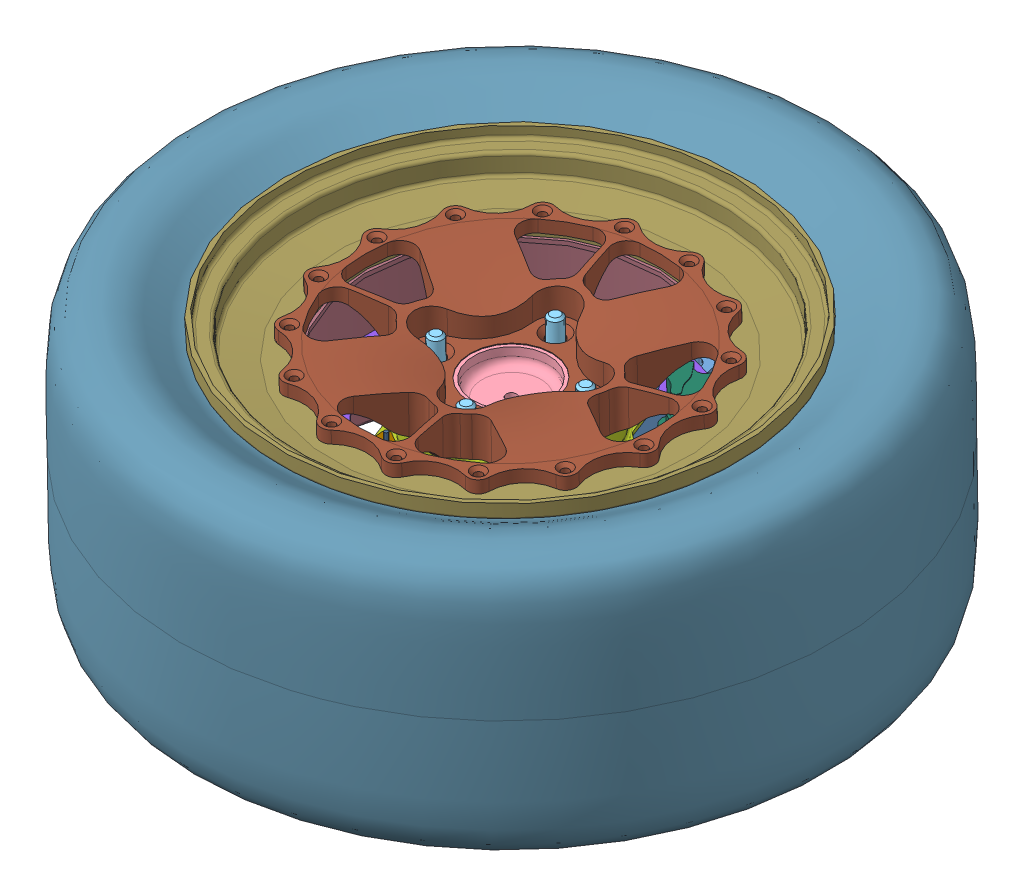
SolidWorks assembly Brake&Wheel.SLDASM, configuration Default (file format 4400). Lengths in mm.
Overall size (684.97 219.6 688.49).
46 component instances, 15 part files, 11 mates.
Components (placement in the parent):
- Upright Assembly - Mirror-3: Upright Assembly - Mirror.SLDASM [Default] at (1.0276 15.994 17.5776) size (187.69 75.94 260.67)
  - Upright - Mirror-1: Upright - Mirror.SLDPRT [AP Caliper] at (-28.1936 -601.3602 -253.5794) size (187.69 75.94 260.67)
  - Oil Seal-1: Oil Seal.SLDPRT [Default] at (-28.1936 8.8942 0.8085) x (0 -0.999848 -0.017452) z (-0.156462 -0.017237 0.987534) size (6.35 67.59 67.59)
  - Oil Seal-2: Oil Seal.SLDPRT [Default] at (-28.1936 -47.6122 -0.1778) x (0 0.999848 0.017452) z (-0.017452 -0.01745 0.999695) size (6.35 67.59 67.59)
  - Tapered Roller Bearing-1: Tapered Roller Bearing.SLDPRT [Default] at (-28.1936 -26.0254 0.199) x (0 -0.999848 -0.017452) z (0.934797 -0.006199 0.355129) size (17 55 55)
  - Tapered Roller Bearing-2: Tapered Roller Bearing.SLDPRT [Default] at (-28.1936 -15.7273 0.3787) x (0 0.999848 0.017452) z (0.612483 -0.013796 0.790364) size (17 55 55)
- Hub Assembly-1: Hub Assembly.SLDASM [Default] at (-27.166 37.2635 18.6021) x (0 0.999848 0.017452) z (-0.859335 0.008925 -0.511335) size (81.66 92.75 92.75)
  - Hub - Aluminum-1: Hub - Aluminum.SLDPRT [SPLIT LINES] at (-63.5 0 0) size (68.33 92.75 92.75)
  - Wheel Stud-1: Wheel Stud.SLDPRT [LUG NUT CUT DOWN] at (-15.24 -33.676 33.676) x (1 0 0) z (0 0.091677 0.995789) size (41.27 15.88 15.88)
  - Wheel Stud-2: Wheel Stud.SLDPRT [LUG NUT CUT DOWN] at (-15.24 33.676 33.676) x (1 0 0) z (0 0.995789 -0.091677) size (41.27 15.88 15.88)
  - Wheel Stud-3: Wheel Stud.SLDPRT [LUG NUT CUT DOWN] at (-15.24 33.676 -33.676) x (1 0 0) z (0 -0.091677 -0.995789) size (41.27 15.88 15.88)
  - Wheel Stud-4: Wheel Stud.SLDPRT [LUG NUT CUT DOWN] at (-15.24 -33.676 -33.676) x (1 0 0) z (0 -0.995789 0.091677) size (41.27 15.88 15.88)
  - Hub Washer-1: Hub Washer.SLDPRT [NO_SPLITLINE] at (-20.0025 0 0) x (1 0 0) z (0 0.089607 0.995977) size (11.11 57.71 57.71)
- Brake Rotor Assembly-1: Brake Rotor Assembly.SLDASM [Default] at (-32.128 51.201 -11.271) x (0 0.999848 0.017452) z (0.969265 0.004294 -0.245981) size (25.4 327.78 327.78)
  - Rotor Hat-1: Rotor Hat.SLDPRT [Default] at (-34.2242 30.4071 -2.5985) size (23.6 152.4 152.4)
  - Rotor - Cast Iron-1: Rotor - Cast Iron.SLDPRT [Default] at (-31.2397 30.4071 -2.5985) x (0 0.707107 0.707107) z (-1 0 0) size (231.78 231.78 3.17)
  - Rotor Washer-1: Rotor Washer.SLDPRT [Default] at (-31.2397 33.0101 -12.653) x (0 0.99948 0.032253) z (1 0 0) size (18.57 10.78 1.59)
  - Rotor Washer-27: Rotor Washer.SLDPRT [Chamfer] at (-34.4147 41.3596 -11.9484) x (0 -0.990749 -0.135705) z (-1 0 0) size (18.57 10.78 1.59)
  - Rotor Pin-6: Rotor Pin.SLDPRT [.5] at (-34.4534 30.4071 68.0135) x (0 0.996402 -0.084747) z (-1 0 0) size (6.36 6.36 12.79)
  - Rotor Washer-13: Rotor Washer.SLDPRT [Default] at (-31.2397 25.1381 -11.5488) x (0 0.729545 -0.683933) z (1 0 0) size (18.57 10.78 1.59)
  - Rotor Washer-14: Rotor Washer.SLDPRT [Default] at (-31.2397 20.3526 -5.2016) x (0 0.032253 -0.99948) z (1 0 0) size (18.57 10.78 1.59)
  - Rotor Washer-15: Rotor Washer.SLDPRT [Default] at (-31.2397 21.4568 2.6705) x (0 -0.683933 -0.729545) z (1 0 0) size (18.57 10.78 1.59)
  - Rotor Washer-16: Rotor Washer.SLDPRT [Default] at (-31.2397 27.804 7.456) x (0 -0.99948 -0.032253) z (1 0 0) size (18.57 10.78 1.59)
  - Rotor Washer-17: Rotor Washer.SLDPRT [Default] at (-31.2397 35.676 6.3518) x (0 -0.729545 0.683933) z (1 0 0) size (18.57 10.78 1.59)
  - Rotor Pin-7: Rotor Pin.SLDPRT [.5] at (-34.4534 80.3373 47.3317) x (0 0.644638 -0.764488) z (-1 0 0) size (6.36 6.36 12.79)
  - Rotor Pin-8: Rotor Pin.SLDPRT [.5] at (-34.4534 101.0191 -2.5985) x (0 -0.084747 -0.996402) z (-1 0 0) size (6.36 6.36 12.79)
  - Rotor Pin-9: Rotor Pin.SLDPRT [.5] at (-34.4534 80.3373 -52.5287) x (0 -0.764488 -0.644638) z (-1 0 0) size (6.36 6.36 12.79)
  - Rotor Pin-10: Rotor Pin.SLDPRT [.5] at (-34.4534 30.4071 -73.2105) x (0 -0.996402 0.084747) z (-1 0 0) size (6.36 6.36 12.79)
  - Rotor Pin-11: Rotor Pin.SLDPRT [.5] at (-34.4534 -19.5231 -52.5287) x (0 -0.644638 0.764488) z (-1 0 0) size (6.36 6.36 12.79)
  - Rotor Pin-12: Rotor Pin.SLDPRT [.5] at (-34.4534 -40.2049 -2.5985) x (0 0.084747 0.996402) z (-1 0 0) size (6.36 6.36 12.79)
  - Rotor Pin-13: Rotor Pin.SLDPRT [.5] at (-34.4534 -19.5231 47.3317) x (0 0.764488 0.644638) z (-1 0 0) size (6.36 6.36 12.79)
  - Rotor Washer-25: Rotor Washer.SLDPRT [Default] at (-31.2397 40.4616 0.0046) x (0 -0.032253 0.99948) z (1 0 0) size (18.57 10.78 1.59)
  - Rotor Washer-26: Rotor Washer.SLDPRT [Default] at (-31.2397 39.3573 -7.8675) x (0 0.683933 0.729545) z (1 0 0) size (18.57 10.78 1.59)
  - Rotor Washer-28: Rotor Washer.SLDPRT [Chamfer] at (-34.4147 31.5403 -16.9545) x (0 -0.796524 0.604608) z (-1 0 0) size (18.57 10.78 1.59)
  - Rotor Washer-29: Rotor Washer.SLDPRT [Chamfer] at (-34.4147 21.0572 -13.551) x (0 -0.135705 0.990749) z (-1 0 0) size (18.57 10.78 1.59)
  - Rotor Washer-30: Rotor Washer.SLDPRT [Chamfer] at (-34.4147 16.0511 -3.7317) x (0 0.604608 0.796524) z (-1 0 0) size (18.57 10.78 1.59)
  - Rotor Washer-31: Rotor Washer.SLDPRT [Chamfer] at (-34.4147 19.4545 6.7514) x (0 0.990749 0.135705) z (-1 0 0) size (18.57 10.78 1.59)
  - Rotor Washer-32: Rotor Washer.SLDPRT [Chamfer] at (-34.4147 29.2738 11.7575) x (0 0.796524 -0.604608) z (-1 0 0) size (18.57 10.78 1.59)
  - Rotor Washer-33: Rotor Washer.SLDPRT [Chamfer] at (-34.4147 39.757 8.3541) x (0 0.135705 -0.990749) z (-1 0 0) size (18.57 10.78 1.59)
  - Rotor Washer-34: Rotor Washer.SLDPRT [Chamfer] at (-34.4147 44.7631 -1.4652) x (0 -0.604608 -0.796524) z (-1 0 0) size (18.57 10.78 1.59)
- Wheel Assembly-1: Wheel Assembly.SLDASM [Default] at (-27.166 65.4533 19.0941) x (-0.246018 0.016916 -0.969118) z (0 0.999848 0.017452) size (563.63 563.63 207.68)
  - Wheel Center - Aluminum-1: Wheel Center - Aluminum.SLDPRT [Default] at origin size (260.35 260.35 36.14)
  - Wheel Shell - Outer-1: Wheel Shell - Outer.SLDPRT [Default] at (0 0 -3.175) x (0 0 1) z (-0.92388 -0.382683 0) size (31.75 355.6 355.6)
  - Wheel Shell - Inner-1: Wheel Shell - Inner.SLDPRT [Default] at (0 0 -3.175) x (0 0 1) z (-0.707107 -0.707107 0) size (151 355.6 355.6)
  - Tire-1: Tire.SLDPRT [Default] at (0 0 -62.8015) x (0 0 -1) z (0.993511 0.113735 0) size (207.68 509.04 509.04)
- Brake Caliper-1: Brake Caliper.SLDPRT [Default] at (73.5704 19.2772 -63.2993) x (-0.62932 0.013563 -0.777028) z (0 -0.999848 -0.017452) size (81.53 52.96 65.79)
Mates (geometry in assembly coordinates):
- Concentric3: concentric anti-aligned: cylinder of Upright Assembly - Mirror-3/Tapered Roller Bearing-2 through (-27.166 0.2667 17.9563) axis (0 -0.999848 -0.017452) radius 15; cylinder of Hub Assembly-1/Hub - Aluminum-1 through (-27.166 183.3399 21.1519) axis (0 0.999848 0.017452) radius 15
- Coincident2: coincident anti-aligned: plane of Upright Assembly - Mirror-3/Tapered Roller Bearing-2 through (-42.5804 17.0556 30.1946) normal (0 0.999848 0.017452); plane of Hub Assembly-1/Hub Washer-1 through (-18.3706 17.4762 6.1041) normal (0 -0.999848 -0.017452)
- Coincident3: coincident anti-aligned: plane of Hub Assembly-1/Hub - Aluminum-1 through (5.3087 38.2159 -35.9574) normal (0 0.999848 0.017452); plane of Brake Rotor Assembly-1/Rotor Hat-1 through (-18.77 36.6862 51.6753) normal (0 -0.999848 -0.017452)
- Concentric9: concentric anti-aligned: cylinder of Hub Assembly-1/Hub - Aluminum-1 through (-27.166 -72.7366 16.682) axis (0 -0.999848 -0.017452) radius 31.75; cylinder of Wheel Assembly-1/Wheel Center - Aluminum-1 through (-27.166 40.0571 18.6509) axis (0 0.999848 0.017452) radius 31.75
- Coincident6: coincident anti-aligned: plane of Brake Rotor Assembly-1/Rotor Hat-1 through (-12.1999 39.0281 77.6052) normal (0 0.999848 0.017452); plane of Wheel Assembly-1/Wheel Center - Aluminum-1 through (-27.166 40.0571 18.6509) normal (0 -0.999848 -0.017452)
- Concentric10: concentric anti-aligned: cylinder of Hub Assembly-1/Wheel Stud-3 through (18.9953 -24.6248 5.8034) axis (0 -0.999848 -0.017452) radius 5.5563; cylinder of Wheel Assembly-1/Wheel Center - Aluminum-1 through (18.9953 40.2616 6.936) axis (0 0.999848 0.017452) radius 6.35
- Concentric11: concentric anti-aligned: cylinder of Hub Assembly-1/Hub - Aluminum-1 through (-27.166 -72.7366 16.682) axis (0 -0.999848 -0.017452) radius 31.75; cylinder of Brake Rotor Assembly-1/Rotor Hat-1 through (-27.166 42.3225 18.6904) axis (0 0.999848 0.017452) radius 31.877
- Concentric12: concentric anti-aligned: cylinder of Hub Assembly-1/Wheel Stud-1 through (-73.3272 -25.0338 29.2331) axis (0 -0.999848 -0.017452) radius 5.5563; cylinder of Brake Rotor Assembly-1/Rotor Hat-1 through (-73.3272 16.251 29.9537) axis (0 0.999848 0.017452) radius 5.5245
- Concentric13: concentric: cylinder of Upright Assembly - Mirror-3/Upright - Mirror-1 through (58.7503 -42.8901 -11.1983) axis (0 0.999848 0.017452) radius 4.0005; cylinder of Brake Caliper-1 through (58.75 -8.266 -10.5943) axis (0 -0.999848 -0.017452) radius 4
- Concentric14: concentric: cylinder of Upright Assembly - Mirror-3/Upright - Mirror-1 through (18.4735 -42.0221 -60.9284) axis (0 0.999848 0.017452) radius 4.0005; cylinder of Brake Caliper-1 through (18.4735 -7.398 -60.324) axis (0 -0.999848 -0.017452) radius 4
- Coincident7: coincident: plane of Upright Assembly - Mirror-3/Upright - Mirror-1 through (34.4967 -8.6751 12.8429) normal (0 0.999848 0.017452); plane of Brake Caliper-1 through (18.4735 -7.398 -60.324) normal (0 -0.999848 -0.017452)
